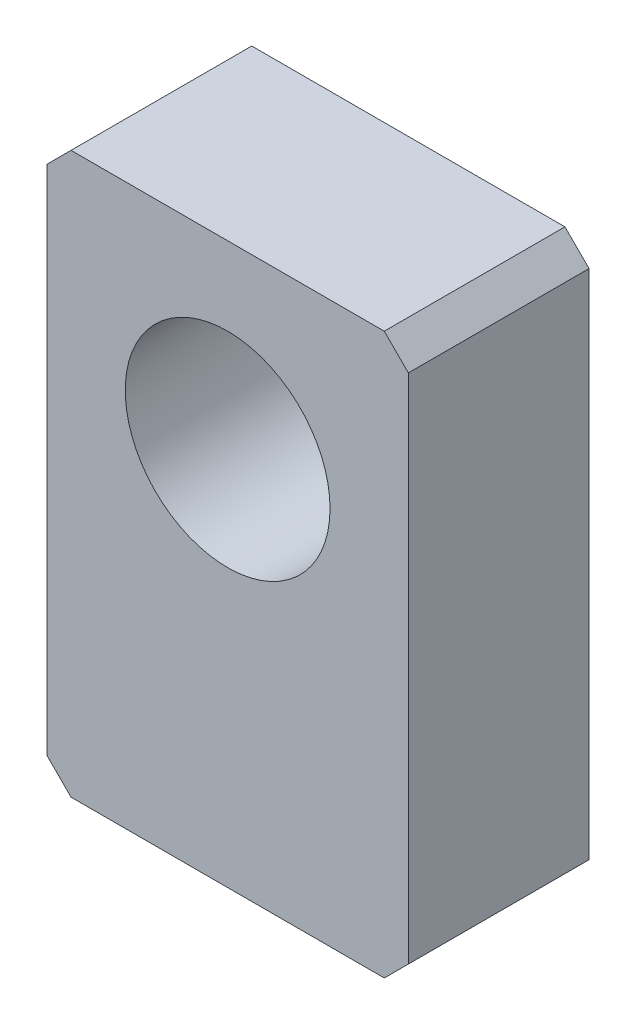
ISO-10303-21;
HEADER;
FILE_DESCRIPTION(('STEP AP214'),'2;1');
FILE_NAME('part.step','',(''),(''),'','','');
FILE_SCHEMA(('AUTOMOTIVE_DESIGN { 1 0 10303 214 1 1 1 1 }'));
ENDSEC;
DATA;
#1=APPLICATION_CONTEXT('core data for automotive mechanical design processes');
#2=APPLICATION_PROTOCOL_DEFINITION('international standard','automotive_design',2000,#1);
#3=PRODUCT_CONTEXT('',#1,'mechanical');
#4=PRODUCT('Part','Part','',(#3));
#5=PRODUCT_RELATED_PRODUCT_CATEGORY('part','',(#4));
#6=PRODUCT_DEFINITION_FORMATION('','',#4);
#7=PRODUCT_DEFINITION_CONTEXT('part definition',#1,'design');
#8=PRODUCT_DEFINITION('design','',#6,#7);
#9=PRODUCT_DEFINITION_SHAPE('','',#8);
#10=(LENGTH_UNIT() NAMED_UNIT(*) SI_UNIT(.MILLI.,.METRE.));
#11=(NAMED_UNIT(*) PLANE_ANGLE_UNIT() SI_UNIT($,.RADIAN.));
#12=(NAMED_UNIT(*) SI_UNIT($,.STERADIAN.) SOLID_ANGLE_UNIT());
#13=UNCERTAINTY_MEASURE_WITH_UNIT(LENGTH_MEASURE(1.E-05),#10,'distance_accuracy_value','');
#14=(GEOMETRIC_REPRESENTATION_CONTEXT(3) GLOBAL_UNCERTAINTY_ASSIGNED_CONTEXT((#13)) GLOBAL_UNIT_ASSIGNED_CONTEXT((#10,
#11,#12)) REPRESENTATION_CONTEXT('',''));
#15=CARTESIAN_POINT('',(0.,0.,0.));
#16=DIRECTION('',(0.,0.,1.));
#17=DIRECTION('',(1.,0.,0.));
#18=AXIS2_PLACEMENT_3D('',#15,#16,#17);
#19=CARTESIAN_POINT('',(0.,0.,3.));
#20=DIRECTION('',(0.,0.,1.));
#21=DIRECTION('',(1.,0.,0.));
#22=AXIS2_PLACEMENT_3D('',#19,#20,#21);
#23=PLANE('',#22);
#24=DIRECTION('',(0.707106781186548,-0.707106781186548,0.));
#25=VECTOR('',#24,1.);
#26=CARTESIAN_POINT('',(-3.,-5.9,3.));
#27=LINE('',#26,#25);
#28=CARTESIAN_POINT('',(-3.,-5.9,3.));
#29=VERTEX_POINT('',#28);
#30=CARTESIAN_POINT('',(-2.6,-6.3,3.));
#31=VERTEX_POINT('',#30);
#32=EDGE_CURVE('E155',#29,#31,#27,.T.);
#33=ORIENTED_EDGE('',*,*,#32,.T.);
#34=DIRECTION('',(1.,0.,0.));
#35=VECTOR('',#34,1.);
#36=CARTESIAN_POINT('',(-2.6,-6.3,3.));
#37=LINE('',#36,#35);
#38=CARTESIAN_POINT('',(2.6,-6.3,3.));
#39=VERTEX_POINT('',#38);
#40=EDGE_CURVE('E103',#31,#39,#37,.T.);
#41=ORIENTED_EDGE('',*,*,#40,.T.);
#42=DIRECTION('',(0.707106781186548,0.707106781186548,0.));
#43=VECTOR('',#42,1.);
#44=CARTESIAN_POINT('',(2.6,-6.3,3.));
#45=LINE('',#44,#43);
#46=CARTESIAN_POINT('',(3.,-5.9,3.));
#47=VERTEX_POINT('',#46);
#48=EDGE_CURVE('E170',#39,#47,#45,.T.);
#49=ORIENTED_EDGE('',*,*,#48,.T.);
#50=DIRECTION('',(0.,1.,0.));
#51=VECTOR('',#50,1.);
#52=CARTESIAN_POINT('',(3.,-5.9,3.));
#53=LINE('',#52,#51);
#54=CARTESIAN_POINT('',(3.,2.6,3.));
#55=VERTEX_POINT('',#54);
#56=EDGE_CURVE('E183',#47,#55,#53,.T.);
#57=ORIENTED_EDGE('',*,*,#56,.T.);
#58=DIRECTION('',(-0.707106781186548,0.707106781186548,0.));
#59=VECTOR('',#58,1.);
#60=CARTESIAN_POINT('',(3.,2.6,3.));
#61=LINE('',#60,#59);
#62=CARTESIAN_POINT('',(2.6,3.,3.));
#63=VERTEX_POINT('',#62);
#64=EDGE_CURVE('E122',#55,#63,#61,.T.);
#65=ORIENTED_EDGE('',*,*,#64,.T.);
#66=DIRECTION('',(-1.,0.,0.));
#67=VECTOR('',#66,1.);
#68=CARTESIAN_POINT('',(2.6,3.,3.));
#69=LINE('',#68,#67);
#70=CARTESIAN_POINT('',(-2.6,3.,3.));
#71=VERTEX_POINT('',#70);
#72=EDGE_CURVE('E116',#63,#71,#69,.T.);
#73=ORIENTED_EDGE('',*,*,#72,.T.);
#74=DIRECTION('',(-0.707106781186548,-0.707106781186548,0.));
#75=VECTOR('',#74,1.);
#76=CARTESIAN_POINT('',(-2.6,3.,3.));
#77=LINE('',#76,#75);
#78=CARTESIAN_POINT('',(-3.,2.6,3.));
#79=VERTEX_POINT('',#78);
#80=EDGE_CURVE('E120',#71,#79,#77,.T.);
#81=ORIENTED_EDGE('',*,*,#80,.T.);
#82=DIRECTION('',(0.,-1.,0.));
#83=VECTOR('',#82,1.);
#84=CARTESIAN_POINT('',(-3.,2.6,3.));
#85=LINE('',#84,#83);
#86=EDGE_CURVE('E60',#79,#29,#85,.T.);
#87=ORIENTED_EDGE('',*,*,#86,.T.);
#88=EDGE_LOOP('',(#33,#41,#49,#57,#65,#73,#81,#87));
#89=FACE_BOUND('',#88,.T.);
#90=CARTESIAN_POINT('',(0.,0.,3.));
#91=DIRECTION('',(0.,0.,1.));
#92=DIRECTION('',(1.,0.,0.));
#93=AXIS2_PLACEMENT_3D('',#90,#91,#92);
#94=CIRCLE('',#93,1.7);
#95=CARTESIAN_POINT('',(1.7,0.,3.));
#96=VERTEX_POINT('',#95);
#97=EDGE_CURVE('E144',#96,#96,#94,.T.);
#98=ORIENTED_EDGE('',*,*,#97,.F.);
#99=EDGE_LOOP('',(#98));
#100=FACE_BOUND('',#99,.T.);
#101=ADVANCED_FACE('F43',(#89,#100),#23,.T.);
#102=CARTESIAN_POINT('',(0.,0.,0.));
#103=DIRECTION('',(0.,0.,1.));
#104=DIRECTION('',(1.,0.,0.));
#105=AXIS2_PLACEMENT_3D('',#102,#103,#104);
#106=PLANE('',#105);
#107=DIRECTION('',(0.707106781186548,-0.707106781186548,0.));
#108=VECTOR('',#107,1.);
#109=CARTESIAN_POINT('',(-3.,-5.9,0.));
#110=LINE('',#109,#108);
#111=CARTESIAN_POINT('',(-3.,-5.9,0.));
#112=VERTEX_POINT('',#111);
#113=CARTESIAN_POINT('',(-2.6,-6.3,0.));
#114=VERTEX_POINT('',#113);
#115=EDGE_CURVE('E140',#112,#114,#110,.T.);
#116=ORIENTED_EDGE('',*,*,#115,.F.);
#117=DIRECTION('',(0.,-1.,0.));
#118=VECTOR('',#117,1.);
#119=CARTESIAN_POINT('',(-3.,2.6,0.));
#120=LINE('',#119,#118);
#121=CARTESIAN_POINT('',(-3.,2.6,0.));
#122=VERTEX_POINT('',#121);
#123=EDGE_CURVE('E95',#122,#112,#120,.T.);
#124=ORIENTED_EDGE('',*,*,#123,.F.);
#125=DIRECTION('',(-0.707106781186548,-0.707106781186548,0.));
#126=VECTOR('',#125,1.);
#127=CARTESIAN_POINT('',(-2.6,3.,0.));
#128=LINE('',#127,#126);
#129=CARTESIAN_POINT('',(-2.6,3.,0.));
#130=VERTEX_POINT('',#129);
#131=EDGE_CURVE('E89',#130,#122,#128,.T.);
#132=ORIENTED_EDGE('',*,*,#131,.F.);
#133=DIRECTION('',(-1.,0.,0.));
#134=VECTOR('',#133,1.);
#135=CARTESIAN_POINT('',(2.6,3.,0.));
#136=LINE('',#135,#134);
#137=CARTESIAN_POINT('',(2.6,3.,0.));
#138=VERTEX_POINT('',#137);
#139=EDGE_CURVE('E130',#138,#130,#136,.T.);
#140=ORIENTED_EDGE('',*,*,#139,.F.);
#141=DIRECTION('',(-0.707106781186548,0.707106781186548,0.));
#142=VECTOR('',#141,1.);
#143=CARTESIAN_POINT('',(3.,2.6,0.));
#144=LINE('',#143,#142);
#145=CARTESIAN_POINT('',(3.,2.6,0.));
#146=VERTEX_POINT('',#145);
#147=EDGE_CURVE('E150',#146,#138,#144,.T.);
#148=ORIENTED_EDGE('',*,*,#147,.F.);
#149=DIRECTION('',(0.,1.,0.));
#150=VECTOR('',#149,1.);
#151=CARTESIAN_POINT('',(3.,-5.9,0.));
#152=LINE('',#151,#150);
#153=CARTESIAN_POINT('',(3.,-5.9,0.));
#154=VERTEX_POINT('',#153);
#155=EDGE_CURVE('E148',#154,#146,#152,.T.);
#156=ORIENTED_EDGE('',*,*,#155,.F.);
#157=DIRECTION('',(0.707106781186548,0.707106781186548,0.));
#158=VECTOR('',#157,1.);
#159=CARTESIAN_POINT('',(2.6,-6.3,0.));
#160=LINE('',#159,#158);
#161=CARTESIAN_POINT('',(2.6,-6.3,0.));
#162=VERTEX_POINT('',#161);
#163=EDGE_CURVE('E146',#162,#154,#160,.T.);
#164=ORIENTED_EDGE('',*,*,#163,.F.);
#165=DIRECTION('',(1.,0.,0.));
#166=VECTOR('',#165,1.);
#167=CARTESIAN_POINT('',(-2.6,-6.3,0.));
#168=LINE('',#167,#166);
#169=EDGE_CURVE('E143',#114,#162,#168,.T.);
#170=ORIENTED_EDGE('',*,*,#169,.F.);
#171=EDGE_LOOP('',(#116,#124,#132,#140,#148,#156,#164,#170));
#172=FACE_BOUND('',#171,.T.);
#173=CARTESIAN_POINT('',(0.,0.,0.));
#174=DIRECTION('',(0.,0.,1.));
#175=DIRECTION('',(1.,0.,0.));
#176=AXIS2_PLACEMENT_3D('',#173,#174,#175);
#177=CIRCLE('',#176,1.7);
#178=CARTESIAN_POINT('',(1.7,0.,0.));
#179=VERTEX_POINT('',#178);
#180=EDGE_CURVE('E189',#179,#179,#177,.T.);
#181=ORIENTED_EDGE('',*,*,#180,.T.);
#182=EDGE_LOOP('',(#181));
#183=FACE_BOUND('',#182,.T.);
#184=ADVANCED_FACE('F174',(#172,#183),#106,.F.);
#185=CARTESIAN_POINT('',(-3.,-5.9,3.));
#186=DIRECTION('',(0.707106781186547,0.707106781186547,0.));
#187=DIRECTION('',(-0.707106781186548,0.707106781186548,0.));
#188=AXIS2_PLACEMENT_3D('',#185,#186,#187);
#189=PLANE('',#188);
#190=ORIENTED_EDGE('',*,*,#115,.T.);
#191=DIRECTION('',(0.,0.,-1.));
#192=VECTOR('',#191,1.);
#193=CARTESIAN_POINT('',(-2.6,-6.3,3.));
#194=LINE('',#193,#192);
#195=EDGE_CURVE('E11',#31,#114,#194,.T.);
#196=ORIENTED_EDGE('',*,*,#195,.F.);
#197=ORIENTED_EDGE('',*,*,#32,.F.);
#198=DIRECTION('',(0.,0.,-1.));
#199=VECTOR('',#198,1.);
#200=CARTESIAN_POINT('',(-3.,-5.9,3.));
#201=LINE('',#200,#199);
#202=EDGE_CURVE('E136',#29,#112,#201,.T.);
#203=ORIENTED_EDGE('',*,*,#202,.T.);
#204=EDGE_LOOP('',(#190,#196,#197,#203));
#205=FACE_BOUND('',#204,.T.);
#206=ADVANCED_FACE('F45',(#205),#189,.F.);
#207=CARTESIAN_POINT('',(-2.6,-6.3,3.));
#208=DIRECTION('',(0.,1.,0.));
#209=DIRECTION('',(0.,0.,1.));
#210=AXIS2_PLACEMENT_3D('',#207,#208,#209);
#211=PLANE('',#210);
#212=ORIENTED_EDGE('',*,*,#169,.T.);
#213=DIRECTION('',(0.,0.,-1.));
#214=VECTOR('',#213,1.);
#215=CARTESIAN_POINT('',(2.6,-6.3,3.));
#216=LINE('',#215,#214);
#217=EDGE_CURVE('E52',#39,#162,#216,.T.);
#218=ORIENTED_EDGE('',*,*,#217,.F.);
#219=ORIENTED_EDGE('',*,*,#40,.F.);
#220=ORIENTED_EDGE('',*,*,#195,.T.);
#221=EDGE_LOOP('',(#212,#218,#219,#220));
#222=FACE_BOUND('',#221,.T.);
#223=ADVANCED_FACE('F217',(#222),#211,.F.);
#224=CARTESIAN_POINT('',(2.6,-6.3,3.));
#225=DIRECTION('',(-0.707106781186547,0.707106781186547,0.));
#226=DIRECTION('',(-0.707106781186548,-0.707106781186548,0.));
#227=AXIS2_PLACEMENT_3D('',#224,#225,#226);
#228=PLANE('',#227);
#229=ORIENTED_EDGE('',*,*,#163,.T.);
#230=DIRECTION('',(0.,0.,-1.));
#231=VECTOR('',#230,1.);
#232=CARTESIAN_POINT('',(3.,-5.9,3.));
#233=LINE('',#232,#231);
#234=EDGE_CURVE('E162',#47,#154,#233,.T.);
#235=ORIENTED_EDGE('',*,*,#234,.F.);
#236=ORIENTED_EDGE('',*,*,#48,.F.);
#237=ORIENTED_EDGE('',*,*,#217,.T.);
#238=EDGE_LOOP('',(#229,#235,#236,#237));
#239=FACE_BOUND('',#238,.T.);
#240=ADVANCED_FACE('F168',(#239),#228,.F.);
#241=CARTESIAN_POINT('',(3.,-5.9,3.));
#242=DIRECTION('',(-1.,0.,0.));
#243=DIRECTION('',(0.,0.,1.));
#244=AXIS2_PLACEMENT_3D('',#241,#242,#243);
#245=PLANE('',#244);
#246=ORIENTED_EDGE('',*,*,#155,.T.);
#247=DIRECTION('',(0.,0.,-1.));
#248=VECTOR('',#247,1.);
#249=CARTESIAN_POINT('',(3.,2.6,3.));
#250=LINE('',#249,#248);
#251=EDGE_CURVE('E159',#55,#146,#250,.T.);
#252=ORIENTED_EDGE('',*,*,#251,.F.);
#253=ORIENTED_EDGE('',*,*,#56,.F.);
#254=ORIENTED_EDGE('',*,*,#234,.T.);
#255=EDGE_LOOP('',(#246,#252,#253,#254));
#256=FACE_BOUND('',#255,.T.);
#257=ADVANCED_FACE('F179',(#256),#245,.F.);
#258=CARTESIAN_POINT('',(3.,2.6,3.));
#259=DIRECTION('',(-0.707106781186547,-0.707106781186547,0.));
#260=DIRECTION('',(0.707106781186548,-0.707106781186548,0.));
#261=AXIS2_PLACEMENT_3D('',#258,#259,#260);
#262=PLANE('',#261);
#263=ORIENTED_EDGE('',*,*,#147,.T.);
#264=DIRECTION('',(0.,0.,-1.));
#265=VECTOR('',#264,1.);
#266=CARTESIAN_POINT('',(2.6,3.,3.));
#267=LINE('',#266,#265);
#268=EDGE_CURVE('E131',#63,#138,#267,.T.);
#269=ORIENTED_EDGE('',*,*,#268,.F.);
#270=ORIENTED_EDGE('',*,*,#64,.F.);
#271=ORIENTED_EDGE('',*,*,#251,.T.);
#272=EDGE_LOOP('',(#263,#269,#270,#271));
#273=FACE_BOUND('',#272,.T.);
#274=ADVANCED_FACE('F182',(#273),#262,.F.);
#275=CARTESIAN_POINT('',(2.6,3.,3.));
#276=DIRECTION('',(0.,-1.,0.));
#277=DIRECTION('',(0.,0.,-1.));
#278=AXIS2_PLACEMENT_3D('',#275,#276,#277);
#279=PLANE('',#278);
#280=ORIENTED_EDGE('',*,*,#139,.T.);
#281=DIRECTION('',(0.,0.,-1.));
#282=VECTOR('',#281,1.);
#283=CARTESIAN_POINT('',(-2.6,3.,3.));
#284=LINE('',#283,#282);
#285=EDGE_CURVE('E127',#71,#130,#284,.T.);
#286=ORIENTED_EDGE('',*,*,#285,.F.);
#287=ORIENTED_EDGE('',*,*,#72,.F.);
#288=ORIENTED_EDGE('',*,*,#268,.T.);
#289=EDGE_LOOP('',(#280,#286,#287,#288));
#290=FACE_BOUND('',#289,.T.);
#291=ADVANCED_FACE('F128',(#290),#279,.F.);
#292=CARTESIAN_POINT('',(-2.6,3.,3.));
#293=DIRECTION('',(0.707106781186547,-0.707106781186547,0.));
#294=DIRECTION('',(0.707106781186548,0.707106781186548,0.));
#295=AXIS2_PLACEMENT_3D('',#292,#293,#294);
#296=PLANE('',#295);
#297=ORIENTED_EDGE('',*,*,#131,.T.);
#298=DIRECTION('',(0.,0.,-1.));
#299=VECTOR('',#298,1.);
#300=CARTESIAN_POINT('',(-3.,2.6,3.));
#301=LINE('',#300,#299);
#302=EDGE_CURVE('E132',#79,#122,#301,.T.);
#303=ORIENTED_EDGE('',*,*,#302,.F.);
#304=ORIENTED_EDGE('',*,*,#80,.F.);
#305=ORIENTED_EDGE('',*,*,#285,.T.);
#306=EDGE_LOOP('',(#297,#303,#304,#305));
#307=FACE_BOUND('',#306,.T.);
#308=ADVANCED_FACE('F134',(#307),#296,.F.);
#309=CARTESIAN_POINT('',(-3.,2.6,3.));
#310=DIRECTION('',(1.,0.,0.));
#311=DIRECTION('',(0.,0.,-1.));
#312=AXIS2_PLACEMENT_3D('',#309,#310,#311);
#313=PLANE('',#312);
#314=ORIENTED_EDGE('',*,*,#123,.T.);
#315=ORIENTED_EDGE('',*,*,#202,.F.);
#316=ORIENTED_EDGE('',*,*,#86,.F.);
#317=ORIENTED_EDGE('',*,*,#302,.T.);
#318=EDGE_LOOP('',(#314,#315,#316,#317));
#319=FACE_BOUND('',#318,.T.);
#320=ADVANCED_FACE('F205',(#319),#313,.F.);
#321=CARTESIAN_POINT('',(0.,0.,3.));
#322=DIRECTION('',(0.,0.,-1.));
#323=DIRECTION('',(-1.,0.,0.));
#324=AXIS2_PLACEMENT_3D('',#321,#322,#323);
#325=CYLINDRICAL_SURFACE('',#324,1.7);
#326=ORIENTED_EDGE('',*,*,#97,.T.);
#327=EDGE_LOOP('',(#326));
#328=FACE_BOUND('',#327,.T.);
#329=ORIENTED_EDGE('',*,*,#180,.F.);
#330=EDGE_LOOP('',(#329));
#331=FACE_BOUND('',#330,.T.);
#332=ADVANCED_FACE('F195',(#328,#331),#325,.F.);
#333=CLOSED_SHELL('',(#101,#184,#206,#223,#240,#257,#274,#291,#308,#320,#332));
#334=MANIFOLD_SOLID_BREP('B2',#333);
#335=ADVANCED_BREP_SHAPE_REPRESENTATION('',(#18,#334),#14);
#336=SHAPE_DEFINITION_REPRESENTATION(#9,#335);
ENDSEC;
END-ISO-10303-21;
